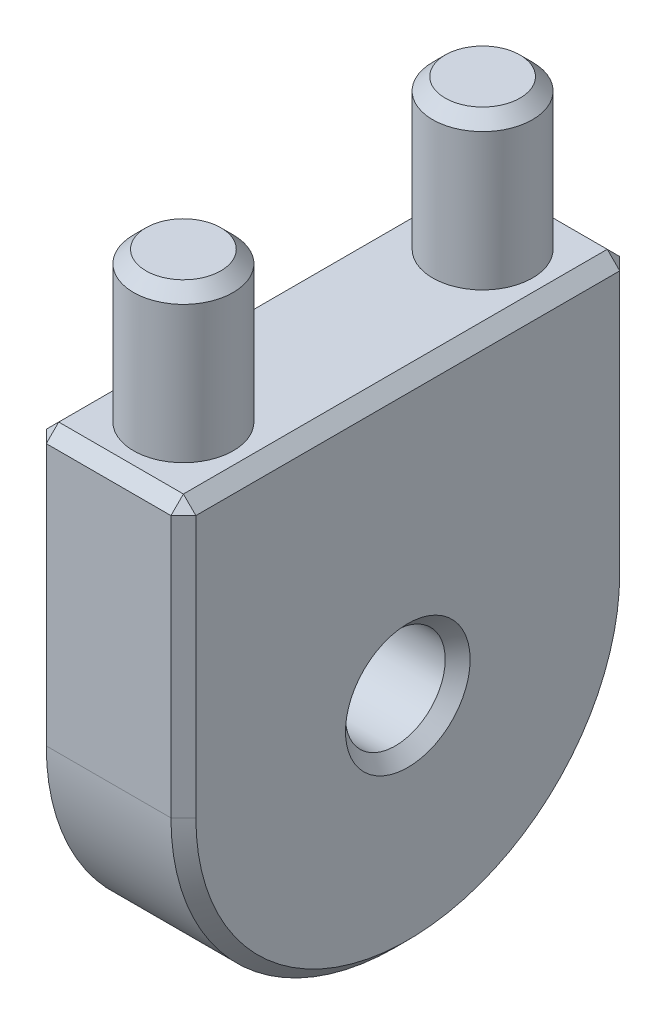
ISO-10303-21;
HEADER;
FILE_DESCRIPTION(('STEP AP214'),'2;1');
FILE_NAME('part.step','',(''),(''),'','','');
FILE_SCHEMA(('AUTOMOTIVE_DESIGN { 1 0 10303 214 1 1 1 1 }'));
ENDSEC;
DATA;
#1=APPLICATION_CONTEXT('core data for automotive mechanical design processes');
#2=APPLICATION_PROTOCOL_DEFINITION('international standard','automotive_design',2000,#1);
#3=PRODUCT_CONTEXT('',#1,'mechanical');
#4=PRODUCT('Part','Part','',(#3));
#5=PRODUCT_RELATED_PRODUCT_CATEGORY('part','',(#4));
#6=PRODUCT_DEFINITION_FORMATION('','',#4);
#7=PRODUCT_DEFINITION_CONTEXT('part definition',#1,'design');
#8=PRODUCT_DEFINITION('design','',#6,#7);
#9=PRODUCT_DEFINITION_SHAPE('','',#8);
#10=(LENGTH_UNIT() NAMED_UNIT(*) SI_UNIT(.MILLI.,.METRE.));
#11=(NAMED_UNIT(*) PLANE_ANGLE_UNIT() SI_UNIT($,.RADIAN.));
#12=(NAMED_UNIT(*) SI_UNIT($,.STERADIAN.) SOLID_ANGLE_UNIT());
#13=UNCERTAINTY_MEASURE_WITH_UNIT(LENGTH_MEASURE(1.E-05),#10,'distance_accuracy_value','');
#14=(GEOMETRIC_REPRESENTATION_CONTEXT(3) GLOBAL_UNCERTAINTY_ASSIGNED_CONTEXT((#13)) GLOBAL_UNIT_ASSIGNED_CONTEXT((#10,
#11,#12)) REPRESENTATION_CONTEXT('',''));
#15=CARTESIAN_POINT('',(0.,0.,0.));
#16=DIRECTION('',(0.,0.,1.));
#17=DIRECTION('',(1.,0.,0.));
#18=AXIS2_PLACEMENT_3D('',#15,#16,#17);
#19=CARTESIAN_POINT('',(3.,11.,9.));
#20=DIRECTION('',(0.,-1.,0.));
#21=DIRECTION('',(0.,0.,-1.));
#22=AXIS2_PLACEMENT_3D('',#19,#20,#21);
#23=PLANE('',#22);
#24=DIRECTION('',(-1.,0.,0.));
#25=VECTOR('',#24,1.);
#26=CARTESIAN_POINT('',(3.,11.,-8.5));
#27=LINE('',#26,#25);
#28=CARTESIAN_POINT('',(2.5,11.,-8.5));
#29=VERTEX_POINT('',#28);
#30=CARTESIAN_POINT('',(-2.5,11.,-8.5));
#31=VERTEX_POINT('',#30);
#32=EDGE_CURVE('E227',#29,#31,#27,.T.);
#33=ORIENTED_EDGE('',*,*,#32,.T.);
#34=DIRECTION('',(0.,0.,1.));
#35=VECTOR('',#34,1.);
#36=CARTESIAN_POINT('',(-2.5,11.,9.));
#37=LINE('',#36,#35);
#38=CARTESIAN_POINT('',(-2.5,11.,8.5));
#39=VERTEX_POINT('',#38);
#40=EDGE_CURVE('E229',#31,#39,#37,.T.);
#41=ORIENTED_EDGE('',*,*,#40,.T.);
#42=DIRECTION('',(1.,0.,0.));
#43=VECTOR('',#42,1.);
#44=CARTESIAN_POINT('',(3.,11.,8.5));
#45=LINE('',#44,#43);
#46=CARTESIAN_POINT('',(2.5,11.,8.5));
#47=VERTEX_POINT('',#46);
#48=EDGE_CURVE('E223',#39,#47,#45,.T.);
#49=ORIENTED_EDGE('',*,*,#48,.T.);
#50=DIRECTION('',(0.,0.,-1.));
#51=VECTOR('',#50,1.);
#52=CARTESIAN_POINT('',(2.5,11.,-9.));
#53=LINE('',#52,#51);
#54=EDGE_CURVE('E225',#47,#29,#53,.T.);
#55=ORIENTED_EDGE('',*,*,#54,.T.);
#56=EDGE_LOOP('',(#33,#41,#49,#55));
#57=FACE_BOUND('',#56,.T.);
#58=CARTESIAN_POINT('',(0.,11.,-6.));
#59=DIRECTION('',(0.,-1.,0.));
#60=DIRECTION('',(0.,0.,-1.));
#61=AXIS2_PLACEMENT_3D('',#58,#59,#60);
#62=CIRCLE('',#61,2.);
#63=CARTESIAN_POINT('',(0.,11.,-8.));
#64=VERTEX_POINT('',#63);
#65=EDGE_CURVE('E180',#64,#64,#62,.F.);
#66=ORIENTED_EDGE('',*,*,#65,.F.);
#67=EDGE_LOOP('',(#66));
#68=FACE_BOUND('',#67,.T.);
#69=CARTESIAN_POINT('',(0.,11.,6.));
#70=DIRECTION('',(0.,-1.,0.));
#71=DIRECTION('',(0.,0.,-1.));
#72=AXIS2_PLACEMENT_3D('',#69,#70,#71);
#73=CIRCLE('',#72,2.);
#74=CARTESIAN_POINT('',(0.,11.,4.));
#75=VERTEX_POINT('',#74);
#76=EDGE_CURVE('E185',#75,#75,#73,.F.);
#77=ORIENTED_EDGE('',*,*,#76,.F.);
#78=EDGE_LOOP('',(#77));
#79=FACE_BOUND('',#78,.T.);
#80=ADVANCED_FACE('F31',(#57,#68,#79),#23,.F.);
#81=CARTESIAN_POINT('',(3.,0.,0.));
#82=DIRECTION('',(1.,0.,0.));
#83=DIRECTION('',(0.,0.,-1.));
#84=AXIS2_PLACEMENT_3D('',#81,#82,#83);
#85=PLANE('',#84);
#86=CARTESIAN_POINT('',(3.,0.,0.));
#87=DIRECTION('',(1.,0.,0.));
#88=DIRECTION('',(0.,0.,-1.));
#89=AXIS2_PLACEMENT_3D('',#86,#87,#88);
#90=CIRCLE('',#89,2.5);
#91=CARTESIAN_POINT('',(3.,0.,-2.5));
#92=VERTEX_POINT('',#91);
#93=EDGE_CURVE('E213',#92,#92,#90,.F.);
#94=ORIENTED_EDGE('',*,*,#93,.T.);
#95=EDGE_LOOP('',(#94));
#96=FACE_BOUND('',#95,.T.);
#97=DIRECTION('',(0.,0.,1.));
#98=VECTOR('',#97,1.);
#99=CARTESIAN_POINT('',(3.,10.5,9.));
#100=LINE('',#99,#98);
#101=CARTESIAN_POINT('',(3.,10.5,-8.5));
#102=VERTEX_POINT('',#101);
#103=CARTESIAN_POINT('',(3.,10.5,8.5));
#104=VERTEX_POINT('',#103);
#105=EDGE_CURVE('E204',#102,#104,#100,.T.);
#106=ORIENTED_EDGE('',*,*,#105,.T.);
#107=DIRECTION('',(0.,-1.,0.));
#108=VECTOR('',#107,1.);
#109=CARTESIAN_POINT('',(3.,0.,8.5));
#110=LINE('',#109,#108);
#111=CARTESIAN_POINT('',(3.,0.,8.5));
#112=VERTEX_POINT('',#111);
#113=EDGE_CURVE('E210',#104,#112,#110,.T.);
#114=ORIENTED_EDGE('',*,*,#113,.T.);
#115=CARTESIAN_POINT('',(3.,0.,0.));
#116=DIRECTION('',(1.,0.,0.));
#117=DIRECTION('',(0.,0.,-1.));
#118=AXIS2_PLACEMENT_3D('',#115,#116,#117);
#119=CIRCLE('',#118,8.5);
#120=CARTESIAN_POINT('',(3.,0.,-8.5));
#121=VERTEX_POINT('',#120);
#122=EDGE_CURVE('E208',#112,#121,#119,.T.);
#123=ORIENTED_EDGE('',*,*,#122,.T.);
#124=DIRECTION('',(0.,1.,0.));
#125=VECTOR('',#124,1.);
#126=CARTESIAN_POINT('',(3.,11.,-8.5));
#127=LINE('',#126,#125);
#128=EDGE_CURVE('E206',#121,#102,#127,.T.);
#129=ORIENTED_EDGE('',*,*,#128,.T.);
#130=EDGE_LOOP('',(#106,#114,#123,#129));
#131=FACE_BOUND('',#130,.T.);
#132=ADVANCED_FACE('F271',(#96,#131),#85,.T.);
#133=CARTESIAN_POINT('',(-3.,0.,0.));
#134=DIRECTION('',(1.,0.,0.));
#135=DIRECTION('',(0.,0.,-1.));
#136=AXIS2_PLACEMENT_3D('',#133,#134,#135);
#137=PLANE('',#136);
#138=CARTESIAN_POINT('',(-3.,0.,0.));
#139=DIRECTION('',(1.,0.,0.));
#140=DIRECTION('',(0.,0.,-1.));
#141=AXIS2_PLACEMENT_3D('',#138,#139,#140);
#142=CIRCLE('',#141,2.50000000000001);
#143=CARTESIAN_POINT('',(-3.,0.,-2.50000000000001));
#144=VERTEX_POINT('',#143);
#145=EDGE_CURVE('E195',#144,#144,#142,.T.);
#146=ORIENTED_EDGE('',*,*,#145,.T.);
#147=EDGE_LOOP('',(#146));
#148=FACE_BOUND('',#147,.T.);
#149=DIRECTION('',(0.,0.,-1.));
#150=VECTOR('',#149,1.);
#151=CARTESIAN_POINT('',(-3.,10.5,0.));
#152=LINE('',#151,#150);
#153=CARTESIAN_POINT('',(-3.,10.5,8.5));
#154=VERTEX_POINT('',#153);
#155=CARTESIAN_POINT('',(-3.,10.5,-8.5));
#156=VERTEX_POINT('',#155);
#157=EDGE_CURVE('E120',#154,#156,#152,.T.);
#158=ORIENTED_EDGE('',*,*,#157,.T.);
#159=DIRECTION('',(0.,-1.,0.));
#160=VECTOR('',#159,1.);
#161=CARTESIAN_POINT('',(-3.,0.,-8.5));
#162=LINE('',#161,#160);
#163=CARTESIAN_POINT('',(-3.,0.,-8.5));
#164=VERTEX_POINT('',#163);
#165=EDGE_CURVE('E116',#156,#164,#162,.T.);
#166=ORIENTED_EDGE('',*,*,#165,.T.);
#167=CARTESIAN_POINT('',(-3.,0.,0.));
#168=DIRECTION('',(1.,0.,0.));
#169=DIRECTION('',(0.,0.,-1.));
#170=AXIS2_PLACEMENT_3D('',#167,#168,#169);
#171=CIRCLE('',#170,8.5);
#172=CARTESIAN_POINT('',(-3.,0.,8.5));
#173=VERTEX_POINT('',#172);
#174=EDGE_CURVE('E110',#164,#173,#171,.F.);
#175=ORIENTED_EDGE('',*,*,#174,.T.);
#176=DIRECTION('',(0.,1.,0.));
#177=VECTOR('',#176,1.);
#178=CARTESIAN_POINT('',(-3.,0.,8.5));
#179=LINE('',#178,#177);
#180=EDGE_CURVE('E113',#173,#154,#179,.T.);
#181=ORIENTED_EDGE('',*,*,#180,.T.);
#182=EDGE_LOOP('',(#158,#166,#175,#181));
#183=FACE_BOUND('',#182,.T.);
#184=ADVANCED_FACE('F112',(#148,#183),#137,.F.);
#185=CARTESIAN_POINT('',(3.,0.,0.));
#186=DIRECTION('',(-1.,0.,0.));
#187=DIRECTION('',(0.,0.,1.));
#188=AXIS2_PLACEMENT_3D('',#185,#186,#187);
#189=CYLINDRICAL_SURFACE('',#188,9.);
#190=DIRECTION('',(-1.,0.,0.));
#191=VECTOR('',#190,1.);
#192=CARTESIAN_POINT('',(3.,0.,9.));
#193=LINE('',#192,#191);
#194=CARTESIAN_POINT('',(2.5,0.,9.));
#195=VERTEX_POINT('',#194);
#196=CARTESIAN_POINT('',(-2.5,0.,9.));
#197=VERTEX_POINT('',#196);
#198=EDGE_CURVE('E171',#195,#197,#193,.T.);
#199=ORIENTED_EDGE('',*,*,#198,.T.);
#200=CARTESIAN_POINT('',(-2.5,0.,0.));
#201=DIRECTION('',(1.,0.,0.));
#202=DIRECTION('',(0.,0.,-1.));
#203=AXIS2_PLACEMENT_3D('',#200,#201,#202);
#204=CIRCLE('',#203,9.);
#205=CARTESIAN_POINT('',(-2.5,0.,-9.));
#206=VERTEX_POINT('',#205);
#207=EDGE_CURVE('E134',#197,#206,#204,.T.);
#208=ORIENTED_EDGE('',*,*,#207,.T.);
#209=DIRECTION('',(-1.,0.,0.));
#210=VECTOR('',#209,1.);
#211=CARTESIAN_POINT('',(3.,0.,-9.));
#212=LINE('',#211,#210);
#213=CARTESIAN_POINT('',(2.5,0.,-9.));
#214=VERTEX_POINT('',#213);
#215=EDGE_CURVE('E176',#214,#206,#212,.T.);
#216=ORIENTED_EDGE('',*,*,#215,.F.);
#217=CARTESIAN_POINT('',(2.5,0.,0.));
#218=DIRECTION('',(1.,0.,0.));
#219=DIRECTION('',(0.,0.,-1.));
#220=AXIS2_PLACEMENT_3D('',#217,#218,#219);
#221=CIRCLE('',#220,9.);
#222=EDGE_CURVE('E232',#214,#195,#221,.F.);
#223=ORIENTED_EDGE('',*,*,#222,.T.);
#224=EDGE_LOOP('',(#199,#208,#216,#223));
#225=FACE_BOUND('',#224,.T.);
#226=ADVANCED_FACE('F262',(#225),#189,.T.);
#227=CARTESIAN_POINT('',(3.,11.,-9.));
#228=DIRECTION('',(0.,0.,1.));
#229=DIRECTION('',(1.,0.,0.));
#230=AXIS2_PLACEMENT_3D('',#227,#228,#229);
#231=PLANE('',#230);
#232=ORIENTED_EDGE('',*,*,#215,.T.);
#233=DIRECTION('',(0.,1.,0.));
#234=VECTOR('',#233,1.);
#235=CARTESIAN_POINT('',(-2.5,11.,-9.));
#236=LINE('',#235,#234);
#237=CARTESIAN_POINT('',(-2.5,10.5,-9.));
#238=VERTEX_POINT('',#237);
#239=EDGE_CURVE('E220',#206,#238,#236,.T.);
#240=ORIENTED_EDGE('',*,*,#239,.T.);
#241=DIRECTION('',(1.,0.,0.));
#242=VECTOR('',#241,1.);
#243=CARTESIAN_POINT('',(3.,10.5,-9.));
#244=LINE('',#243,#242);
#245=CARTESIAN_POINT('',(2.5,10.5,-9.));
#246=VERTEX_POINT('',#245);
#247=EDGE_CURVE('E216',#238,#246,#244,.T.);
#248=ORIENTED_EDGE('',*,*,#247,.T.);
#249=DIRECTION('',(0.,-1.,0.));
#250=VECTOR('',#249,1.);
#251=CARTESIAN_POINT('',(2.5,0.,-9.));
#252=LINE('',#251,#250);
#253=EDGE_CURVE('E218',#246,#214,#252,.T.);
#254=ORIENTED_EDGE('',*,*,#253,.T.);
#255=EDGE_LOOP('',(#232,#240,#248,#254));
#256=FACE_BOUND('',#255,.T.);
#257=ADVANCED_FACE('F259',(#256),#231,.F.);
#258=CARTESIAN_POINT('',(3.,0.,9.));
#259=DIRECTION('',(0.,0.,-1.));
#260=DIRECTION('',(-1.,0.,0.));
#261=AXIS2_PLACEMENT_3D('',#258,#259,#260);
#262=PLANE('',#261);
#263=DIRECTION('',(-1.,0.,0.));
#264=VECTOR('',#263,1.);
#265=CARTESIAN_POINT('',(3.,10.5,9.));
#266=LINE('',#265,#264);
#267=CARTESIAN_POINT('',(2.5,10.5,9.));
#268=VERTEX_POINT('',#267);
#269=CARTESIAN_POINT('',(-2.5,10.5,9.));
#270=VERTEX_POINT('',#269);
#271=EDGE_CURVE('E48',#268,#270,#266,.T.);
#272=ORIENTED_EDGE('',*,*,#271,.T.);
#273=DIRECTION('',(0.,-1.,0.));
#274=VECTOR('',#273,1.);
#275=CARTESIAN_POINT('',(-2.5,0.,9.));
#276=LINE('',#275,#274);
#277=EDGE_CURVE('E237',#270,#197,#276,.T.);
#278=ORIENTED_EDGE('',*,*,#277,.T.);
#279=ORIENTED_EDGE('',*,*,#198,.F.);
#280=DIRECTION('',(0.,1.,0.));
#281=VECTOR('',#280,1.);
#282=CARTESIAN_POINT('',(2.5,11.,9.));
#283=LINE('',#282,#281);
#284=EDGE_CURVE('E53',#195,#268,#283,.T.);
#285=ORIENTED_EDGE('',*,*,#284,.T.);
#286=EDGE_LOOP('',(#272,#278,#279,#285));
#287=FACE_BOUND('',#286,.T.);
#288=ADVANCED_FACE('F284',(#287),#262,.F.);
#289=CARTESIAN_POINT('',(3.,0.,0.));
#290=DIRECTION('',(-1.,0.,0.));
#291=DIRECTION('',(0.,0.,1.));
#292=AXIS2_PLACEMENT_3D('',#289,#290,#291);
#293=CYLINDRICAL_SURFACE('',#292,2.);
#294=CARTESIAN_POINT('',(-2.49999999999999,0.,0.));
#295=DIRECTION('',(1.,0.,0.));
#296=DIRECTION('',(0.,0.,-1.));
#297=AXIS2_PLACEMENT_3D('',#294,#295,#296);
#298=CIRCLE('',#297,2.);
#299=CARTESIAN_POINT('',(-2.49999999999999,0.,-2.));
#300=VERTEX_POINT('',#299);
#301=EDGE_CURVE('E201',#300,#300,#298,.F.);
#302=ORIENTED_EDGE('',*,*,#301,.T.);
#303=EDGE_LOOP('',(#302));
#304=FACE_BOUND('',#303,.T.);
#305=CARTESIAN_POINT('',(2.5,0.,0.));
#306=DIRECTION('',(1.,0.,0.));
#307=DIRECTION('',(0.,0.,-1.));
#308=AXIS2_PLACEMENT_3D('',#305,#306,#307);
#309=CIRCLE('',#308,2.);
#310=CARTESIAN_POINT('',(2.5,0.,-2.));
#311=VERTEX_POINT('',#310);
#312=EDGE_CURVE('E198',#311,#311,#309,.T.);
#313=ORIENTED_EDGE('',*,*,#312,.T.);
#314=EDGE_LOOP('',(#313));
#315=FACE_BOUND('',#314,.T.);
#316=ADVANCED_FACE('F486',(#304,#315),#293,.F.);
#317=CARTESIAN_POINT('',(0.,17.,-6.));
#318=DIRECTION('',(0.,-1.,0.));
#319=DIRECTION('',(0.,0.,-1.));
#320=AXIS2_PLACEMENT_3D('',#317,#318,#319);
#321=CYLINDRICAL_SURFACE('',#320,2.);
#322=CARTESIAN_POINT('',(0.,16.5,-6.));
#323=DIRECTION('',(0.,1.,0.));
#324=DIRECTION('',(0.,0.,1.));
#325=AXIS2_PLACEMENT_3D('',#322,#323,#324);
#326=CIRCLE('',#325,2.);
#327=CARTESIAN_POINT('',(0.,16.5,-4.));
#328=VERTEX_POINT('',#327);
#329=EDGE_CURVE('E131',#328,#328,#326,.F.);
#330=ORIENTED_EDGE('',*,*,#329,.T.);
#331=EDGE_LOOP('',(#330));
#332=FACE_BOUND('',#331,.T.);
#333=ORIENTED_EDGE('',*,*,#65,.T.);
#334=EDGE_LOOP('',(#333));
#335=FACE_BOUND('',#334,.T.);
#336=ADVANCED_FACE('F477',(#332,#335),#321,.T.);
#337=CARTESIAN_POINT('',(0.,17.,-6.));
#338=DIRECTION('',(0.,1.,0.));
#339=DIRECTION('',(0.,0.,1.));
#340=AXIS2_PLACEMENT_3D('',#337,#338,#339);
#341=PLANE('',#340);
#342=CARTESIAN_POINT('',(0.,17.,-6.));
#343=DIRECTION('',(0.,1.,0.));
#344=DIRECTION('',(0.,0.,1.));
#345=AXIS2_PLACEMENT_3D('',#342,#343,#344);
#346=CIRCLE('',#345,1.5);
#347=CARTESIAN_POINT('',(0.,17.,-4.5));
#348=VERTEX_POINT('',#347);
#349=EDGE_CURVE('E188',#348,#348,#346,.T.);
#350=ORIENTED_EDGE('',*,*,#349,.T.);
#351=EDGE_LOOP('',(#350));
#352=FACE_BOUND('',#351,.T.);
#353=ADVANCED_FACE('F468',(#352),#341,.T.);
#354=CARTESIAN_POINT('',(0.,17.,6.));
#355=DIRECTION('',(0.,-1.,0.));
#356=DIRECTION('',(0.,0.,-1.));
#357=AXIS2_PLACEMENT_3D('',#354,#355,#356);
#358=CYLINDRICAL_SURFACE('',#357,2.);
#359=CARTESIAN_POINT('',(0.,16.5,6.));
#360=DIRECTION('',(0.,1.,0.));
#361=DIRECTION('',(0.,0.,1.));
#362=AXIS2_PLACEMENT_3D('',#359,#360,#361);
#363=CIRCLE('',#362,2.);
#364=CARTESIAN_POINT('',(0.,16.5,8.));
#365=VERTEX_POINT('',#364);
#366=EDGE_CURVE('E11',#365,#365,#363,.F.);
#367=ORIENTED_EDGE('',*,*,#366,.T.);
#368=EDGE_LOOP('',(#367));
#369=FACE_BOUND('',#368,.T.);
#370=ORIENTED_EDGE('',*,*,#76,.T.);
#371=EDGE_LOOP('',(#370));
#372=FACE_BOUND('',#371,.T.);
#373=ADVANCED_FACE('F459',(#369,#372),#358,.T.);
#374=CARTESIAN_POINT('',(0.,17.,6.));
#375=DIRECTION('',(0.,1.,0.));
#376=DIRECTION('',(0.,0.,1.));
#377=AXIS2_PLACEMENT_3D('',#374,#375,#376);
#378=PLANE('',#377);
#379=CARTESIAN_POINT('',(0.,17.,6.));
#380=DIRECTION('',(0.,1.,0.));
#381=DIRECTION('',(0.,0.,1.));
#382=AXIS2_PLACEMENT_3D('',#379,#380,#381);
#383=CIRCLE('',#382,1.5);
#384=CARTESIAN_POINT('',(0.,17.,7.50000000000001));
#385=VERTEX_POINT('',#384);
#386=EDGE_CURVE('E40',#385,#385,#383,.T.);
#387=ORIENTED_EDGE('',*,*,#386,.T.);
#388=EDGE_LOOP('',(#387));
#389=FACE_BOUND('',#388,.T.);
#390=ADVANCED_FACE('F316',(#389),#378,.T.);
#391=CARTESIAN_POINT('',(0.,17.,-6.));
#392=DIRECTION('',(0.,-1.,0.));
#393=DIRECTION('',(0.,0.,-1.));
#394=AXIS2_PLACEMENT_3D('',#391,#392,#393);
#395=CONICAL_SURFACE('',#394,1.5,0.78539816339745);
#396=ORIENTED_EDGE('',*,*,#329,.F.);
#397=EDGE_LOOP('',(#396));
#398=FACE_BOUND('',#397,.T.);
#399=ORIENTED_EDGE('',*,*,#349,.F.);
#400=EDGE_LOOP('',(#399));
#401=FACE_BOUND('',#400,.T.);
#402=ADVANCED_FACE('F313',(#398,#401),#395,.T.);
#403=CARTESIAN_POINT('',(-3.,0.,0.));
#404=DIRECTION('',(-1.,0.,0.));
#405=DIRECTION('',(0.,0.,1.));
#406=AXIS2_PLACEMENT_3D('',#403,#404,#405);
#407=CONICAL_SURFACE('',#406,2.50000000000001,0.785398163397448);
#408=ORIENTED_EDGE('',*,*,#301,.F.);
#409=EDGE_LOOP('',(#408));
#410=FACE_BOUND('',#409,.T.);
#411=ORIENTED_EDGE('',*,*,#145,.F.);
#412=EDGE_LOOP('',(#411));
#413=FACE_BOUND('',#412,.T.);
#414=ADVANCED_FACE('F294',(#410,#413),#407,.F.);
#415=CARTESIAN_POINT('',(2.5,0.,0.));
#416=DIRECTION('',(1.,0.,0.));
#417=DIRECTION('',(0.,0.,-1.));
#418=AXIS2_PLACEMENT_3D('',#415,#416,#417);
#419=CONICAL_SURFACE('',#418,2.,0.785398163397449);
#420=ORIENTED_EDGE('',*,*,#93,.F.);
#421=EDGE_LOOP('',(#420));
#422=FACE_BOUND('',#421,.T.);
#423=ORIENTED_EDGE('',*,*,#312,.F.);
#424=EDGE_LOOP('',(#423));
#425=FACE_BOUND('',#424,.T.);
#426=ADVANCED_FACE('F288',(#422,#425),#419,.F.);
#427=CARTESIAN_POINT('',(3.,0.,8.5));
#428=DIRECTION('',(0.707106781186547,0.,0.707106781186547));
#429=DIRECTION('',(0.707106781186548,0.,-0.707106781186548));
#430=AXIS2_PLACEMENT_3D('',#427,#428,#429);
#431=PLANE('',#430);
#432=DIRECTION('',(0.707106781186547,0.,-0.707106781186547));
#433=VECTOR('',#432,1.);
#434=CARTESIAN_POINT('',(2.5,10.5,9.));
#435=LINE('',#434,#433);
#436=EDGE_CURVE('E165',#268,#104,#435,.T.);
#437=ORIENTED_EDGE('',*,*,#436,.F.);
#438=ORIENTED_EDGE('',*,*,#284,.F.);
#439=DIRECTION('',(-0.707106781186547,0.,0.707106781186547));
#440=VECTOR('',#439,1.);
#441=CARTESIAN_POINT('',(3.,0.,8.5));
#442=LINE('',#441,#440);
#443=EDGE_CURVE('E35',#112,#195,#442,.T.);
#444=ORIENTED_EDGE('',*,*,#443,.F.);
#445=ORIENTED_EDGE('',*,*,#113,.F.);
#446=EDGE_LOOP('',(#437,#438,#444,#445));
#447=FACE_BOUND('',#446,.T.);
#448=ADVANCED_FACE('F286',(#447),#431,.T.);
#449=CARTESIAN_POINT('',(3.,0.,0.));
#450=DIRECTION('',(-1.,0.,0.));
#451=DIRECTION('',(0.,0.,1.));
#452=AXIS2_PLACEMENT_3D('',#449,#450,#451);
#453=CONICAL_SURFACE('',#452,8.5,0.785398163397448);
#454=ORIENTED_EDGE('',*,*,#443,.T.);
#455=ORIENTED_EDGE('',*,*,#222,.F.);
#456=DIRECTION('',(-0.707106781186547,0.,-0.707106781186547));
#457=VECTOR('',#456,1.);
#458=CARTESIAN_POINT('',(3.,0.,-8.5));
#459=LINE('',#458,#457);
#460=EDGE_CURVE('E163',#121,#214,#459,.T.);
#461=ORIENTED_EDGE('',*,*,#460,.F.);
#462=ORIENTED_EDGE('',*,*,#122,.F.);
#463=EDGE_LOOP('',(#454,#455,#461,#462));
#464=FACE_BOUND('',#463,.T.);
#465=ADVANCED_FACE('F264',(#464),#453,.T.);
#466=CARTESIAN_POINT('',(2.5,10.5,9.));
#467=DIRECTION('',(0.577350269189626,0.577350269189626,0.577350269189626));
#468=DIRECTION('',(0.707106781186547,0.,-0.707106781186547));
#469=AXIS2_PLACEMENT_3D('',#466,#467,#468);
#470=PLANE('',#469);
#471=DIRECTION('',(0.,0.707106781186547,-0.707106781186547));
#472=VECTOR('',#471,1.);
#473=CARTESIAN_POINT('',(2.5,10.5,9.));
#474=LINE('',#473,#472);
#475=EDGE_CURVE('E157',#268,#47,#474,.T.);
#476=ORIENTED_EDGE('',*,*,#475,.F.);
#477=ORIENTED_EDGE('',*,*,#436,.T.);
#478=DIRECTION('',(-0.707106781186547,0.707106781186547,0.));
#479=VECTOR('',#478,1.);
#480=CARTESIAN_POINT('',(2.75,10.75,8.5));
#481=LINE('',#480,#479);
#482=EDGE_CURVE('E160',#47,#104,#481,.F.);
#483=ORIENTED_EDGE('',*,*,#482,.F.);
#484=EDGE_LOOP('',(#476,#477,#483));
#485=FACE_BOUND('',#484,.T.);
#486=ADVANCED_FACE('F278',(#485),#470,.T.);
#487=CARTESIAN_POINT('',(3.,0.,-8.5));
#488=DIRECTION('',(0.707106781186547,0.,-0.707106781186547));
#489=DIRECTION('',(-0.707106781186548,0.,-0.707106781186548));
#490=AXIS2_PLACEMENT_3D('',#487,#488,#489);
#491=PLANE('',#490);
#492=ORIENTED_EDGE('',*,*,#460,.T.);
#493=ORIENTED_EDGE('',*,*,#253,.F.);
#494=DIRECTION('',(-0.707106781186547,0.,-0.707106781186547));
#495=VECTOR('',#494,1.);
#496=CARTESIAN_POINT('',(3.,10.5,-8.5));
#497=LINE('',#496,#495);
#498=EDGE_CURVE('E154',#102,#246,#497,.T.);
#499=ORIENTED_EDGE('',*,*,#498,.F.);
#500=ORIENTED_EDGE('',*,*,#128,.F.);
#501=EDGE_LOOP('',(#492,#493,#499,#500));
#502=FACE_BOUND('',#501,.T.);
#503=ADVANCED_FACE('F267',(#502),#491,.T.);
#504=CARTESIAN_POINT('',(3.,10.5,0.));
#505=DIRECTION('',(0.707106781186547,0.707106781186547,0.));
#506=DIRECTION('',(-0.707106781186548,0.707106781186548,0.));
#507=AXIS2_PLACEMENT_3D('',#504,#505,#506);
#508=PLANE('',#507);
#509=ORIENTED_EDGE('',*,*,#482,.T.);
#510=ORIENTED_EDGE('',*,*,#105,.F.);
#511=DIRECTION('',(0.707106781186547,-0.707106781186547,0.));
#512=VECTOR('',#511,1.);
#513=CARTESIAN_POINT('',(3.,10.5,-8.5));
#514=LINE('',#513,#512);
#515=EDGE_CURVE('E151',#29,#102,#514,.T.);
#516=ORIENTED_EDGE('',*,*,#515,.F.);
#517=ORIENTED_EDGE('',*,*,#54,.F.);
#518=EDGE_LOOP('',(#509,#510,#516,#517));
#519=FACE_BOUND('',#518,.T.);
#520=ADVANCED_FACE('F275',(#519),#508,.T.);
#521=CARTESIAN_POINT('',(3.,10.5,9.));
#522=DIRECTION('',(0.,-0.707106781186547,-0.707106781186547));
#523=DIRECTION('',(0.,0.707106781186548,-0.707106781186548));
#524=AXIS2_PLACEMENT_3D('',#521,#522,#523);
#525=PLANE('',#524);
#526=ORIENTED_EDGE('',*,*,#475,.T.);
#527=ORIENTED_EDGE('',*,*,#48,.F.);
#528=DIRECTION('',(0.,-0.707106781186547,0.707106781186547));
#529=VECTOR('',#528,1.);
#530=CARTESIAN_POINT('',(-2.5,11.,8.5));
#531=LINE('',#530,#529);
#532=EDGE_CURVE('E148',#270,#39,#531,.F.);
#533=ORIENTED_EDGE('',*,*,#532,.F.);
#534=ORIENTED_EDGE('',*,*,#271,.F.);
#535=EDGE_LOOP('',(#526,#527,#533,#534));
#536=FACE_BOUND('',#535,.T.);
#537=ADVANCED_FACE('F281',(#536),#525,.F.);
#538=CARTESIAN_POINT('',(3.,10.5,-8.5));
#539=DIRECTION('',(0.577350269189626,0.577350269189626,-0.577350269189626));
#540=DIRECTION('',(-0.707106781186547,0.,-0.707106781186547));
#541=AXIS2_PLACEMENT_3D('',#538,#539,#540);
#542=PLANE('',#541);
#543=ORIENTED_EDGE('',*,*,#515,.T.);
#544=ORIENTED_EDGE('',*,*,#498,.T.);
#545=DIRECTION('',(0.,-0.707106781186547,-0.707106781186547));
#546=VECTOR('',#545,1.);
#547=CARTESIAN_POINT('',(2.5,10.75,-8.75));
#548=LINE('',#547,#546);
#549=EDGE_CURVE('E138',#29,#246,#548,.T.);
#550=ORIENTED_EDGE('',*,*,#549,.F.);
#551=EDGE_LOOP('',(#543,#544,#550));
#552=FACE_BOUND('',#551,.T.);
#553=ADVANCED_FACE('F337',(#552),#542,.T.);
#554=CARTESIAN_POINT('',(-2.5,11.,8.5));
#555=DIRECTION('',(-0.577350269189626,0.577350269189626,0.577350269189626));
#556=DIRECTION('',(0.707106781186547,0.,0.707106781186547));
#557=AXIS2_PLACEMENT_3D('',#554,#555,#556);
#558=PLANE('',#557);
#559=DIRECTION('',(0.707106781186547,0.707106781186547,0.));
#560=VECTOR('',#559,1.);
#561=CARTESIAN_POINT('',(-2.5,11.,8.5));
#562=LINE('',#561,#560);
#563=EDGE_CURVE('E135',#154,#39,#562,.T.);
#564=ORIENTED_EDGE('',*,*,#563,.F.);
#565=DIRECTION('',(-0.707106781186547,0.,-0.707106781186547));
#566=VECTOR('',#565,1.);
#567=CARTESIAN_POINT('',(-2.75,10.5,8.75));
#568=LINE('',#567,#566);
#569=EDGE_CURVE('E129',#270,#154,#568,.T.);
#570=ORIENTED_EDGE('',*,*,#569,.F.);
#571=ORIENTED_EDGE('',*,*,#532,.T.);
#572=EDGE_LOOP('',(#564,#570,#571));
#573=FACE_BOUND('',#572,.T.);
#574=ADVANCED_FACE('F283',(#573),#558,.T.);
#575=CARTESIAN_POINT('',(-2.5,0.,9.));
#576=DIRECTION('',(0.707106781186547,0.,-0.707106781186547));
#577=DIRECTION('',(-0.707106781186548,0.,-0.707106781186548));
#578=AXIS2_PLACEMENT_3D('',#575,#576,#577);
#579=PLANE('',#578);
#580=ORIENTED_EDGE('',*,*,#569,.T.);
#581=ORIENTED_EDGE('',*,*,#180,.F.);
#582=DIRECTION('',(-0.707106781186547,0.,-0.707106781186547));
#583=VECTOR('',#582,1.);
#584=CARTESIAN_POINT('',(-2.5,0.,9.));
#585=LINE('',#584,#583);
#586=EDGE_CURVE('E126',#197,#173,#585,.T.);
#587=ORIENTED_EDGE('',*,*,#586,.F.);
#588=ORIENTED_EDGE('',*,*,#277,.F.);
#589=EDGE_LOOP('',(#580,#581,#587,#588));
#590=FACE_BOUND('',#589,.T.);
#591=ADVANCED_FACE('F124',(#590),#579,.F.);
#592=CARTESIAN_POINT('',(3.,11.,-8.5));
#593=DIRECTION('',(0.,-0.707106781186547,0.707106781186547));
#594=DIRECTION('',(0.,-0.707106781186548,-0.707106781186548));
#595=AXIS2_PLACEMENT_3D('',#592,#593,#594);
#596=PLANE('',#595);
#597=ORIENTED_EDGE('',*,*,#549,.T.);
#598=ORIENTED_EDGE('',*,*,#247,.F.);
#599=DIRECTION('',(0.,0.707106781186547,0.707106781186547));
#600=VECTOR('',#599,1.);
#601=CARTESIAN_POINT('',(-2.5,10.5,-9.));
#602=LINE('',#601,#600);
#603=EDGE_CURVE('E136',#31,#238,#602,.F.);
#604=ORIENTED_EDGE('',*,*,#603,.F.);
#605=ORIENTED_EDGE('',*,*,#32,.F.);
#606=EDGE_LOOP('',(#597,#598,#604,#605));
#607=FACE_BOUND('',#606,.T.);
#608=ADVANCED_FACE('F329',(#607),#596,.F.);
#609=CARTESIAN_POINT('',(-2.5,11.,9.));
#610=DIRECTION('',(0.707106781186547,-0.707106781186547,0.));
#611=DIRECTION('',(0.707106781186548,0.707106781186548,0.));
#612=AXIS2_PLACEMENT_3D('',#609,#610,#611);
#613=PLANE('',#612);
#614=ORIENTED_EDGE('',*,*,#563,.T.);
#615=ORIENTED_EDGE('',*,*,#40,.F.);
#616=DIRECTION('',(-0.707106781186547,-0.707106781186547,0.));
#617=VECTOR('',#616,1.);
#618=CARTESIAN_POINT('',(-2.75,10.75,-8.5));
#619=LINE('',#618,#617);
#620=EDGE_CURVE('E141',#156,#31,#619,.F.);
#621=ORIENTED_EDGE('',*,*,#620,.F.);
#622=ORIENTED_EDGE('',*,*,#157,.F.);
#623=EDGE_LOOP('',(#614,#615,#621,#622));
#624=FACE_BOUND('',#623,.T.);
#625=ADVANCED_FACE('F254',(#624),#613,.F.);
#626=CARTESIAN_POINT('',(-2.5,0.,0.));
#627=DIRECTION('',(1.,0.,0.));
#628=DIRECTION('',(0.,0.,-1.));
#629=AXIS2_PLACEMENT_3D('',#626,#627,#628);
#630=CONICAL_SURFACE('',#629,9.,0.785398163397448);
#631=ORIENTED_EDGE('',*,*,#586,.T.);
#632=ORIENTED_EDGE('',*,*,#174,.F.);
#633=DIRECTION('',(-0.707106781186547,0.,0.707106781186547));
#634=VECTOR('',#633,1.);
#635=CARTESIAN_POINT('',(-2.5,0.,-9.));
#636=LINE('',#635,#634);
#637=EDGE_CURVE('E243',#206,#164,#636,.T.);
#638=ORIENTED_EDGE('',*,*,#637,.F.);
#639=ORIENTED_EDGE('',*,*,#207,.F.);
#640=EDGE_LOOP('',(#631,#632,#638,#639));
#641=FACE_BOUND('',#640,.T.);
#642=ADVANCED_FACE('F133',(#641),#630,.T.);
#643=CARTESIAN_POINT('',(-2.5,10.5,-9.));
#644=DIRECTION('',(-0.577350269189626,0.577350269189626,-0.577350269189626));
#645=DIRECTION('',(-0.707106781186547,0.,0.707106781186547));
#646=AXIS2_PLACEMENT_3D('',#643,#644,#645);
#647=PLANE('',#646);
#648=ORIENTED_EDGE('',*,*,#620,.T.);
#649=ORIENTED_EDGE('',*,*,#603,.T.);
#650=DIRECTION('',(0.707106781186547,0.,-0.707106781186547));
#651=VECTOR('',#650,1.);
#652=CARTESIAN_POINT('',(-2.5,10.5,-9.));
#653=LINE('',#652,#651);
#654=EDGE_CURVE('E241',#156,#238,#653,.T.);
#655=ORIENTED_EDGE('',*,*,#654,.F.);
#656=EDGE_LOOP('',(#648,#649,#655));
#657=FACE_BOUND('',#656,.T.);
#658=ADVANCED_FACE('F248',(#657),#647,.T.);
#659=CARTESIAN_POINT('',(-2.5,11.,-9.));
#660=DIRECTION('',(0.707106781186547,0.,0.707106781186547));
#661=DIRECTION('',(0.707106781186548,0.,-0.707106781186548));
#662=AXIS2_PLACEMENT_3D('',#659,#660,#661);
#663=PLANE('',#662);
#664=ORIENTED_EDGE('',*,*,#637,.T.);
#665=ORIENTED_EDGE('',*,*,#165,.F.);
#666=ORIENTED_EDGE('',*,*,#654,.T.);
#667=ORIENTED_EDGE('',*,*,#239,.F.);
#668=EDGE_LOOP('',(#664,#665,#666,#667));
#669=FACE_BOUND('',#668,.T.);
#670=ADVANCED_FACE('F256',(#669),#663,.F.);
#671=CARTESIAN_POINT('',(0.,17.,6.));
#672=DIRECTION('',(0.,-1.,0.));
#673=DIRECTION('',(0.,0.,-1.));
#674=AXIS2_PLACEMENT_3D('',#671,#672,#673);
#675=CONICAL_SURFACE('',#674,1.5,0.78539816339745);
#676=ORIENTED_EDGE('',*,*,#366,.F.);
#677=EDGE_LOOP('',(#676));
#678=FACE_BOUND('',#677,.T.);
#679=ORIENTED_EDGE('',*,*,#386,.F.);
#680=EDGE_LOOP('',(#679));
#681=FACE_BOUND('',#680,.T.);
#682=ADVANCED_FACE('F33',(#678,#681),#675,.T.);
#683=CLOSED_SHELL('',(#80,#132,#184,#226,#257,#288,#316,#336,#353,#373,#390,#402,#414,#426,#448,
#465,#486,#503,#520,#537,#553,#574,#591,#608,#625,#642,#658,#670,#682));
#684=MANIFOLD_SOLID_BREP('B2',#683);
#685=ADVANCED_BREP_SHAPE_REPRESENTATION('',(#18,#684),#14);
#686=SHAPE_DEFINITION_REPRESENTATION(#9,#685);
ENDSEC;
END-ISO-10303-21;
